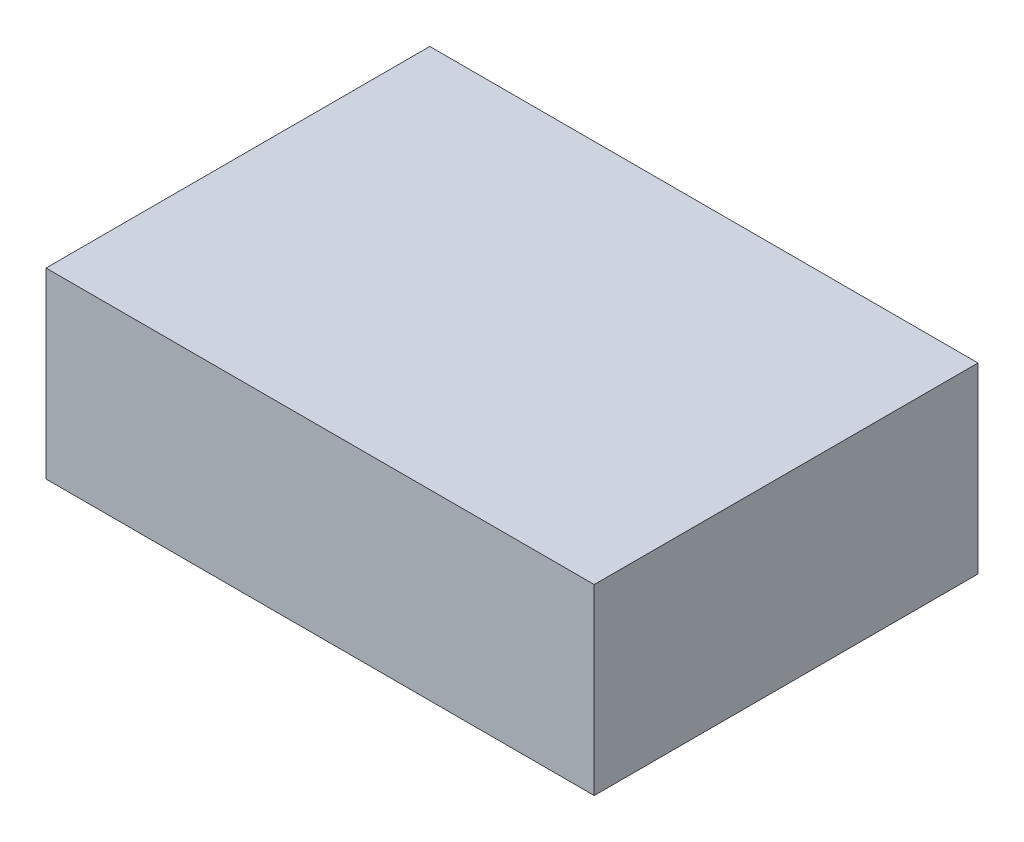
from build123d import *

# Parameters (mm, degrees)
SKETCH1_W      = 152.4
SKETCH1_H      = 106.68
EXTRUDE1_DEPTH = 50.8


with BuildPart() as part:
    # Sketch1 → Extrude1 (new body)
    with BuildSketch(Plane(origin=(0, 0, 0), x_dir=(1, 0, 0), z_dir=(0, 1, 0))):
        with Locations((-280.008198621, 14.174251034)):
            Rectangle(SKETCH1_W, SKETCH1_H)
    extrude(amount=EXTRUDE1_DEPTH)


solid = part.part
